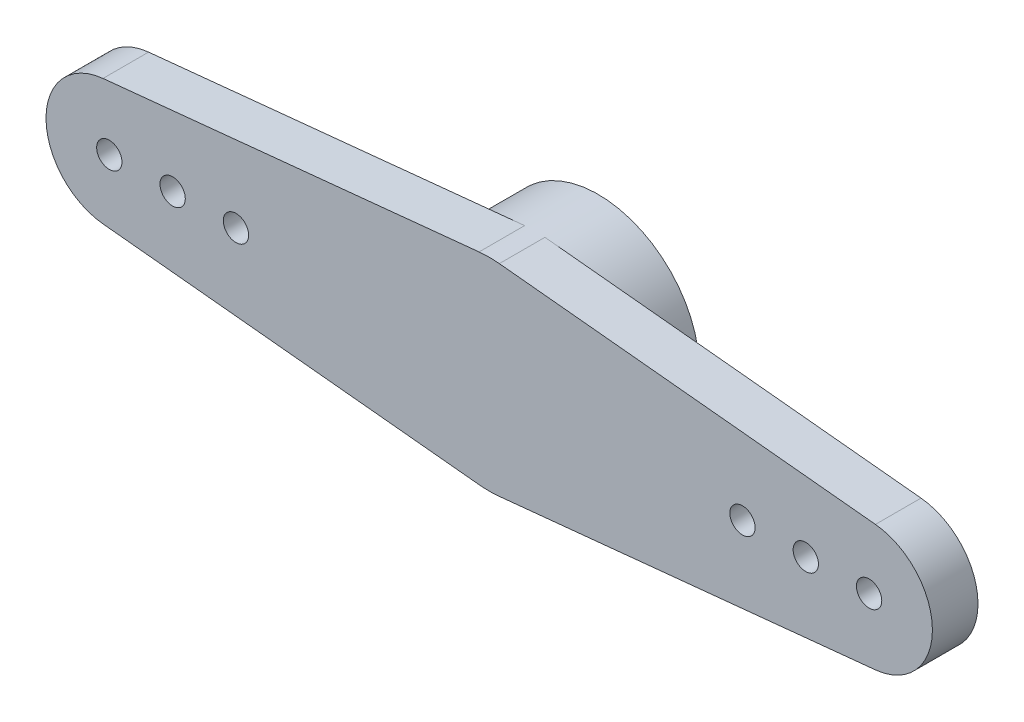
from build123d import *

# Parameters (mm, degrees)
ESQUISSE1_R           = 0.5
EXTRUSION6_DEPTH      = 1.8
EXTRUSION8_DEPTH      = 2.5
EXTRUSION8_DEPTH_BACK = 1.8
ESQUISSE3_R           = 4
ESQUISSE4_R           = 2.5
EXTRUSION9_DEPTH      = 2.7


with BuildPart() as part:
    # Esquisse1 → Extrusion6 (new body)
    with BuildSketch(Plane.XY):
        with BuildLine():
            Line((-15.25, 2.487468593), (-0.4, 3.979949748))
            ThreePointArc((-0.4, 3.979949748), (0, 4), (0.4, 3.979949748))
            Line((0.4, 3.979949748), (15.25, 2.487468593))
            ThreePointArc((15.25, 2.487468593), (17.5, 0), (15.25, -2.487468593))
            Line((15.25, -2.487468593), (0.4, -3.979949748))
            ThreePointArc((0.4, -3.979949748), (0, -4), (-0.4, -3.979949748))
            Line((-0.4, -3.979949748), (-15.25, -2.487468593))
            ThreePointArc((-15.25, -2.487468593), (-17.5, 0), (-15.25, 2.487468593))
        make_face()
        with Locations((-15, 0)):
            Circle(ESQUISSE1_R, mode=Mode.SUBTRACT)
        with Locations((-12.5, 0)):
            Circle(ESQUISSE1_R, mode=Mode.SUBTRACT)
        with Locations((-10, 0)):
            Circle(ESQUISSE1_R, mode=Mode.SUBTRACT)
        with Locations((10, 0)):
            Circle(ESQUISSE1_R, mode=Mode.SUBTRACT)
        with Locations((12.5, 0)):
            Circle(ESQUISSE1_R, mode=Mode.SUBTRACT)
        with Locations((15, 0)):
            Circle(ESQUISSE1_R, mode=Mode.SUBTRACT)
    extrude(amount=EXTRUSION6_DEPTH)

    # Esquisse3 → Extrusion8 (add, two sides: drawn at the far end of the back side and taken through both)
    with BuildSketch(Plane(origin=(0, 0, 0), x_dir=(-1, 0, 0), z_dir=(0, 0, -1)).offset(-EXTRUSION8_DEPTH_BACK)):
        Circle(ESQUISSE3_R)
    extrude(amount=EXTRUSION8_DEPTH + EXTRUSION8_DEPTH_BACK)

    # Esquisse4 → Extrusion9 (cut)
    with BuildSketch(Plane(origin=(0, 0, -2.5), x_dir=(-1, 0, 0), z_dir=(0, 0, -1))):
        Circle(ESQUISSE4_R)
    extrude(amount=-EXTRUSION9_DEPTH, mode=Mode.SUBTRACT)


solid = part.part
